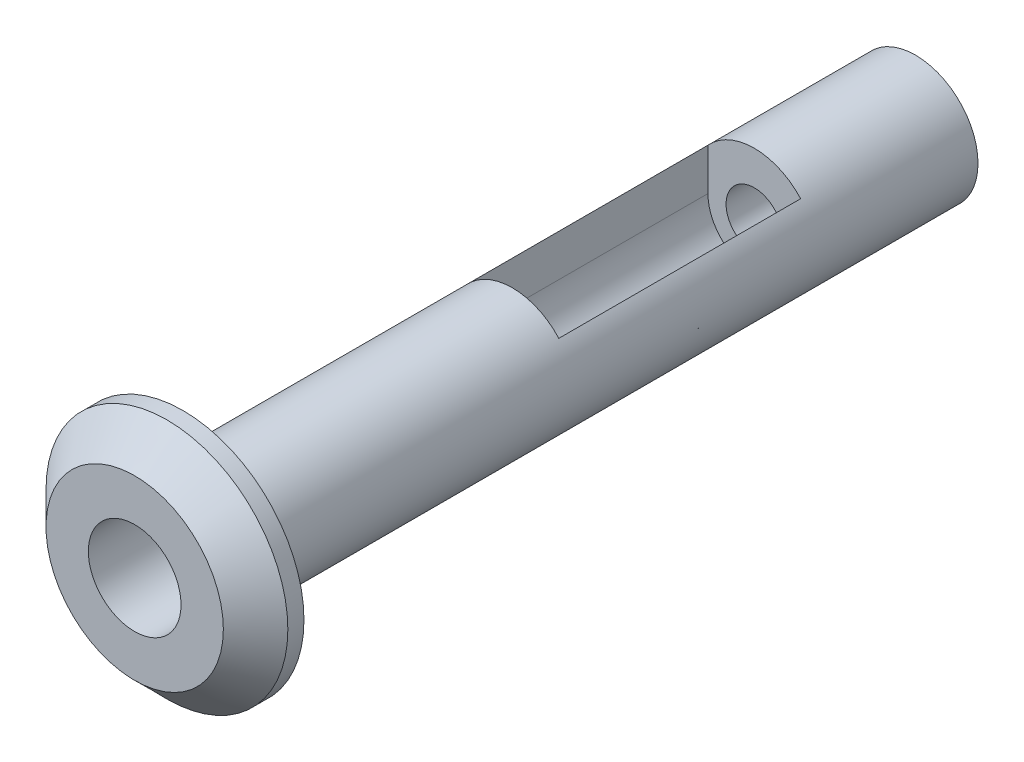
ISO-10303-21;
HEADER;
FILE_DESCRIPTION(('STEP AP214'),'2;1');
FILE_NAME('part.step','',(''),(''),'','','');
FILE_SCHEMA(('AUTOMOTIVE_DESIGN { 1 0 10303 214 1 1 1 1 }'));
ENDSEC;
DATA;
#1=APPLICATION_CONTEXT('core data for automotive mechanical design processes');
#2=APPLICATION_PROTOCOL_DEFINITION('international standard','automotive_design',2000,#1);
#3=PRODUCT_CONTEXT('',#1,'mechanical');
#4=PRODUCT('Part','Part','',(#3));
#5=PRODUCT_RELATED_PRODUCT_CATEGORY('part','',(#4));
#6=PRODUCT_DEFINITION_FORMATION('','',#4);
#7=PRODUCT_DEFINITION_CONTEXT('part definition',#1,'design');
#8=PRODUCT_DEFINITION('design','',#6,#7);
#9=PRODUCT_DEFINITION_SHAPE('','',#8);
#10=(LENGTH_UNIT() NAMED_UNIT(*) SI_UNIT(.MILLI.,.METRE.));
#11=(NAMED_UNIT(*) PLANE_ANGLE_UNIT() SI_UNIT($,.RADIAN.));
#12=(NAMED_UNIT(*) SI_UNIT($,.STERADIAN.) SOLID_ANGLE_UNIT());
#13=UNCERTAINTY_MEASURE_WITH_UNIT(LENGTH_MEASURE(1.E-05),#10,'distance_accuracy_value','');
#14=(GEOMETRIC_REPRESENTATION_CONTEXT(3) GLOBAL_UNCERTAINTY_ASSIGNED_CONTEXT((#13)) GLOBAL_UNIT_ASSIGNED_CONTEXT((#10,
#11,#12)) REPRESENTATION_CONTEXT('',''));
#15=CARTESIAN_POINT('',(0.,0.,0.));
#16=DIRECTION('',(0.,0.,1.));
#17=DIRECTION('',(1.,0.,0.));
#18=AXIS2_PLACEMENT_3D('',#15,#16,#17);
#19=CARTESIAN_POINT('',(0.,0.,-55.0617279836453));
#20=DIRECTION('',(0.,0.,1.));
#21=DIRECTION('',(1.,0.,0.));
#22=AXIS2_PLACEMENT_3D('',#19,#20,#21);
#23=CYLINDRICAL_SURFACE('',#22,2.875);
#24=CARTESIAN_POINT('',(0.,0.,1.5));
#25=DIRECTION('',(0.,0.,1.));
#26=DIRECTION('',(1.,0.,0.));
#27=AXIS2_PLACEMENT_3D('',#24,#25,#26);
#28=CIRCLE('',#27,2.875);
#29=CARTESIAN_POINT('',(2.875,0.,1.5));
#30=VERTEX_POINT('',#29);
#31=EDGE_CURVE('E98',#30,#30,#28,.T.);
#32=ORIENTED_EDGE('',*,*,#31,.T.);
#33=EDGE_LOOP('',(#32));
#34=FACE_BOUND('',#33,.T.);
#35=DIRECTION('',(0.,0.,-1.));
#36=VECTOR('',#35,1.);
#37=CARTESIAN_POINT('',(-2.875,0.,-21.93));
#38=LINE('',#37,#36);
#39=CARTESIAN_POINT('',(-2.875,0.,-21.93));
#40=VERTEX_POINT('',#39);
#41=CARTESIAN_POINT('',(-2.875,0.,-36.93));
#42=VERTEX_POINT('',#41);
#43=EDGE_CURVE('E64',#40,#42,#38,.T.);
#44=ORIENTED_EDGE('',*,*,#43,.F.);
#45=CARTESIAN_POINT('',(0.,0.,-21.93));
#46=DIRECTION('',(0.,0.,1.));
#47=DIRECTION('',(1.,0.,0.));
#48=AXIS2_PLACEMENT_3D('',#45,#46,#47);
#49=CIRCLE('',#48,2.875);
#50=CARTESIAN_POINT('',(2.875,0.,-21.93));
#51=VERTEX_POINT('',#50);
#52=EDGE_CURVE('E12',#40,#51,#49,.F.);
#53=ORIENTED_EDGE('',*,*,#52,.T.);
#54=DIRECTION('',(0.,0.,-1.));
#55=VECTOR('',#54,1.);
#56=CARTESIAN_POINT('',(2.875,0.,-21.93));
#57=LINE('',#56,#55);
#58=CARTESIAN_POINT('',(2.875,0.,-36.93));
#59=VERTEX_POINT('',#58);
#60=EDGE_CURVE('E92',#51,#59,#57,.T.);
#61=ORIENTED_EDGE('',*,*,#60,.T.);
#62=CARTESIAN_POINT('',(0.,0.,-36.93));
#63=DIRECTION('',(0.,0.,-1.));
#64=DIRECTION('',(-1.,0.,0.));
#65=AXIS2_PLACEMENT_3D('',#62,#63,#64);
#66=CIRCLE('',#65,2.875);
#67=EDGE_CURVE('E100',#42,#59,#66,.F.);
#68=ORIENTED_EDGE('',*,*,#67,.F.);
#69=EDGE_LOOP('',(#44,#53,#61,#68));
#70=FACE_BOUND('',#69,.T.);
#71=ADVANCED_FACE('F40',(#34,#70),#23,.F.);
#72=CARTESIAN_POINT('',(0.,0.,-1.5));
#73=DIRECTION('',(0.,0.,1.));
#74=DIRECTION('',(1.,0.,0.));
#75=AXIS2_PLACEMENT_3D('',#72,#73,#74);
#76=PLANE('',#75);
#77=CARTESIAN_POINT('',(0.,0.,-1.5));
#78=DIRECTION('',(0.,0.,1.));
#79=DIRECTION('',(1.,0.,0.));
#80=AXIS2_PLACEMENT_3D('',#77,#78,#79);
#81=CIRCLE('',#80,7.5);
#82=CARTESIAN_POINT('',(7.5,0.,-1.5));
#83=VERTEX_POINT('',#82);
#84=EDGE_CURVE('E121',#83,#83,#81,.T.);
#85=ORIENTED_EDGE('',*,*,#84,.F.);
#86=EDGE_LOOP('',(#85));
#87=FACE_BOUND('',#86,.T.);
#88=CARTESIAN_POINT('',(0.,0.,-1.5));
#89=DIRECTION('',(0.,0.,1.));
#90=DIRECTION('',(1.,0.,0.));
#91=AXIS2_PLACEMENT_3D('',#88,#89,#90);
#92=CIRCLE('',#91,3.875);
#93=CARTESIAN_POINT('',(3.875,0.,-1.5));
#94=VERTEX_POINT('',#93);
#95=EDGE_CURVE('E49',#94,#94,#92,.F.);
#96=ORIENTED_EDGE('',*,*,#95,.F.);
#97=EDGE_LOOP('',(#96));
#98=FACE_BOUND('',#97,.T.);
#99=ADVANCED_FACE('F158',(#87,#98),#76,.F.);
#100=CARTESIAN_POINT('',(0.,0.,1.5));
#101=DIRECTION('',(0.,0.,1.));
#102=DIRECTION('',(1.,0.,0.));
#103=AXIS2_PLACEMENT_3D('',#100,#101,#102);
#104=PLANE('',#103);
#105=ORIENTED_EDGE('',*,*,#31,.F.);
#106=EDGE_LOOP('',(#105));
#107=FACE_BOUND('',#106,.T.);
#108=CARTESIAN_POINT('',(0.,0.,1.5));
#109=DIRECTION('',(0.,0.,1.));
#110=DIRECTION('',(1.,0.,0.));
#111=AXIS2_PLACEMENT_3D('',#108,#109,#110);
#112=CIRCLE('',#111,5.5);
#113=CARTESIAN_POINT('',(5.5,0.,1.5));
#114=VERTEX_POINT('',#113);
#115=EDGE_CURVE('E124',#114,#114,#112,.T.);
#116=ORIENTED_EDGE('',*,*,#115,.T.);
#117=EDGE_LOOP('',(#116));
#118=FACE_BOUND('',#117,.T.);
#119=ADVANCED_FACE('F164',(#107,#118),#104,.T.);
#120=CARTESIAN_POINT('',(0.,0.,1.5));
#121=DIRECTION('',(0.,0.,-1.));
#122=DIRECTION('',(-1.,0.,0.));
#123=AXIS2_PLACEMENT_3D('',#120,#121,#122);
#124=CYLINDRICAL_SURFACE('',#123,7.5);
#125=CARTESIAN_POINT('',(0.,0.,-0.500000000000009));
#126=DIRECTION('',(0.,0.,1.));
#127=DIRECTION('',(1.,0.,0.));
#128=AXIS2_PLACEMENT_3D('',#125,#126,#127);
#129=CIRCLE('',#128,7.5);
#130=CARTESIAN_POINT('',(7.5,0.,-0.500000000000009));
#131=VERTEX_POINT('',#130);
#132=EDGE_CURVE('E127',#131,#131,#129,.F.);
#133=ORIENTED_EDGE('',*,*,#132,.T.);
#134=EDGE_LOOP('',(#133));
#135=FACE_BOUND('',#134,.T.);
#136=ORIENTED_EDGE('',*,*,#84,.T.);
#137=EDGE_LOOP('',(#136));
#138=FACE_BOUND('',#137,.T.);
#139=ADVANCED_FACE('F140',(#135,#138),#124,.T.);
#140=CARTESIAN_POINT('',(0.,0.,1.5));
#141=DIRECTION('',(0.,0.,-1.));
#142=DIRECTION('',(-1.,0.,0.));
#143=AXIS2_PLACEMENT_3D('',#140,#141,#142);
#144=CYLINDRICAL_SURFACE('',#143,1.75);
#145=CARTESIAN_POINT('',(0.,0.,-36.93));
#146=DIRECTION('',(0.,0.,-1.));
#147=DIRECTION('',(-1.,0.,0.));
#148=AXIS2_PLACEMENT_3D('',#145,#146,#147);
#149=CIRCLE('',#148,1.75);
#150=CARTESIAN_POINT('',(-1.75,0.,-36.93));
#151=VERTEX_POINT('',#150);
#152=EDGE_CURVE('E114',#151,#151,#149,.T.);
#153=ORIENTED_EDGE('',*,*,#152,.F.);
#154=EDGE_LOOP('',(#153));
#155=FACE_BOUND('',#154,.T.);
#156=CARTESIAN_POINT('',(0.,0.,-46.93));
#157=DIRECTION('',(0.,0.,-1.));
#158=DIRECTION('',(-1.,0.,0.));
#159=AXIS2_PLACEMENT_3D('',#156,#157,#158);
#160=CIRCLE('',#159,1.75);
#161=CARTESIAN_POINT('',(-1.75,0.,-46.93));
#162=VERTEX_POINT('',#161);
#163=EDGE_CURVE('E115',#162,#162,#160,.T.);
#164=ORIENTED_EDGE('',*,*,#163,.T.);
#165=EDGE_LOOP('',(#164));
#166=FACE_BOUND('',#165,.T.);
#167=ADVANCED_FACE('F137',(#155,#166),#144,.F.);
#168=CARTESIAN_POINT('',(0.,0.,1.5));
#169=DIRECTION('',(0.,0.,-1.));
#170=DIRECTION('',(-1.,0.,0.));
#171=AXIS2_PLACEMENT_3D('',#168,#169,#170);
#172=CONICAL_SURFACE('',#171,5.5,0.785398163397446);
#173=ORIENTED_EDGE('',*,*,#132,.F.);
#174=EDGE_LOOP('',(#173));
#175=FACE_BOUND('',#174,.T.);
#176=ORIENTED_EDGE('',*,*,#115,.F.);
#177=EDGE_LOOP('',(#176));
#178=FACE_BOUND('',#177,.T.);
#179=ADVANCED_FACE('F43',(#175,#178),#172,.T.);
#180=CARTESIAN_POINT('',(0.,0.,-46.93));
#181=DIRECTION('',(0.,0.,-1.));
#182=DIRECTION('',(-1.,0.,0.));
#183=AXIS2_PLACEMENT_3D('',#180,#181,#182);
#184=PLANE('',#183);
#185=CARTESIAN_POINT('',(0.,0.,-46.93));
#186=DIRECTION('',(0.,0.,-1.));
#187=DIRECTION('',(-1.,0.,0.));
#188=AXIS2_PLACEMENT_3D('',#185,#186,#187);
#189=CIRCLE('',#188,3.875);
#190=CARTESIAN_POINT('',(-3.875,0.,-46.93));
#191=VERTEX_POINT('',#190);
#192=EDGE_CURVE('E118',#191,#191,#189,.T.);
#193=ORIENTED_EDGE('',*,*,#192,.T.);
#194=EDGE_LOOP('',(#193));
#195=FACE_BOUND('',#194,.T.);
#196=ORIENTED_EDGE('',*,*,#163,.F.);
#197=EDGE_LOOP('',(#196));
#198=FACE_BOUND('',#197,.T.);
#199=ADVANCED_FACE('F144',(#195,#198),#184,.T.);
#200=CARTESIAN_POINT('',(0.,0.,-46.93));
#201=DIRECTION('',(0.,0.,1.));
#202=DIRECTION('',(1.,0.,0.));
#203=AXIS2_PLACEMENT_3D('',#200,#201,#202);
#204=CYLINDRICAL_SURFACE('',#203,3.875);
#205=DIRECTION('',(0.,0.,-1.));
#206=VECTOR('',#205,1.);
#207=CARTESIAN_POINT('',(2.875,2.59807621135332,-21.93));
#208=LINE('',#207,#206);
#209=CARTESIAN_POINT('',(2.875,2.59807621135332,-21.93));
#210=VERTEX_POINT('',#209);
#211=CARTESIAN_POINT('',(2.875,2.59807621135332,-36.93));
#212=VERTEX_POINT('',#211);
#213=EDGE_CURVE('E56',#210,#212,#208,.T.);
#214=ORIENTED_EDGE('',*,*,#213,.F.);
#215=CARTESIAN_POINT('',(0.,0.,-21.93));
#216=DIRECTION('',(0.,0.,1.));
#217=DIRECTION('',(1.,0.,0.));
#218=AXIS2_PLACEMENT_3D('',#215,#216,#217);
#219=CIRCLE('',#218,3.875);
#220=CARTESIAN_POINT('',(-2.875,2.59807621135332,-21.93));
#221=VERTEX_POINT('',#220);
#222=EDGE_CURVE('E88',#210,#221,#219,.T.);
#223=ORIENTED_EDGE('',*,*,#222,.T.);
#224=DIRECTION('',(0.,0.,-1.));
#225=VECTOR('',#224,1.);
#226=CARTESIAN_POINT('',(-2.875,2.59807621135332,-21.93));
#227=LINE('',#226,#225);
#228=CARTESIAN_POINT('',(-2.875,2.59807621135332,-36.93));
#229=VERTEX_POINT('',#228);
#230=EDGE_CURVE('E101',#221,#229,#227,.T.);
#231=ORIENTED_EDGE('',*,*,#230,.T.);
#232=CARTESIAN_POINT('',(0.,0.,-36.93));
#233=DIRECTION('',(0.,0.,1.));
#234=DIRECTION('',(1.,0.,0.));
#235=AXIS2_PLACEMENT_3D('',#232,#233,#234);
#236=CIRCLE('',#235,3.875);
#237=EDGE_CURVE('E181',#212,#229,#236,.T.);
#238=ORIENTED_EDGE('',*,*,#237,.F.);
#239=EDGE_LOOP('',(#214,#223,#231,#238));
#240=FACE_BOUND('',#239,.T.);
#241=ORIENTED_EDGE('',*,*,#192,.F.);
#242=EDGE_LOOP('',(#241));
#243=FACE_BOUND('',#242,.T.);
#244=ORIENTED_EDGE('',*,*,#95,.T.);
#245=EDGE_LOOP('',(#244));
#246=FACE_BOUND('',#245,.T.);
#247=ADVANCED_FACE('F146',(#240,#243,#246),#204,.T.);
#248=CARTESIAN_POINT('',(0.,0.,-36.93));
#249=DIRECTION('',(0.,0.,-1.));
#250=DIRECTION('',(-1.,0.,0.));
#251=AXIS2_PLACEMENT_3D('',#248,#249,#250);
#252=PLANE('',#251);
#253=ORIENTED_EDGE('',*,*,#152,.T.);
#254=EDGE_LOOP('',(#253));
#255=FACE_BOUND('',#254,.T.);
#256=DIRECTION('',(0.,-1.,0.));
#257=VECTOR('',#256,1.);
#258=CARTESIAN_POINT('',(-2.875,0.,-36.93));
#259=LINE('',#258,#257);
#260=EDGE_CURVE('E89',#229,#42,#259,.T.);
#261=ORIENTED_EDGE('',*,*,#260,.T.);
#262=ORIENTED_EDGE('',*,*,#67,.T.);
#263=DIRECTION('',(0.,1.,0.));
#264=VECTOR('',#263,1.);
#265=CARTESIAN_POINT('',(2.875,0.,-36.93));
#266=LINE('',#265,#264);
#267=EDGE_CURVE('E94',#59,#212,#266,.T.);
#268=ORIENTED_EDGE('',*,*,#267,.T.);
#269=ORIENTED_EDGE('',*,*,#237,.T.);
#270=EDGE_LOOP('',(#261,#262,#268,#269));
#271=FACE_BOUND('',#270,.T.);
#272=ADVANCED_FACE('F134',(#255,#271),#252,.F.);
#273=CARTESIAN_POINT('',(0.,0.,-21.93));
#274=DIRECTION('',(0.,0.,1.));
#275=DIRECTION('',(1.,0.,0.));
#276=AXIS2_PLACEMENT_3D('',#273,#274,#275);
#277=PLANE('',#276);
#278=DIRECTION('',(0.,-1.,0.));
#279=VECTOR('',#278,1.);
#280=CARTESIAN_POINT('',(-2.875,0.,-21.93));
#281=LINE('',#280,#279);
#282=EDGE_CURVE('E102',#221,#40,#281,.T.);
#283=ORIENTED_EDGE('',*,*,#282,.F.);
#284=ORIENTED_EDGE('',*,*,#222,.F.);
#285=DIRECTION('',(0.,1.,0.));
#286=VECTOR('',#285,1.);
#287=CARTESIAN_POINT('',(2.875,0.,-21.93));
#288=LINE('',#287,#286);
#289=EDGE_CURVE('E83',#51,#210,#288,.T.);
#290=ORIENTED_EDGE('',*,*,#289,.F.);
#291=ORIENTED_EDGE('',*,*,#52,.F.);
#292=EDGE_LOOP('',(#283,#284,#290,#291));
#293=FACE_BOUND('',#292,.T.);
#294=ADVANCED_FACE('F86',(#293),#277,.F.);
#295=CARTESIAN_POINT('',(2.875,0.,-21.93));
#296=DIRECTION('',(-1.,0.,0.));
#297=DIRECTION('',(0.,0.,1.));
#298=AXIS2_PLACEMENT_3D('',#295,#296,#297);
#299=PLANE('',#298);
#300=ORIENTED_EDGE('',*,*,#267,.F.);
#301=ORIENTED_EDGE('',*,*,#60,.F.);
#302=ORIENTED_EDGE('',*,*,#289,.T.);
#303=ORIENTED_EDGE('',*,*,#213,.T.);
#304=EDGE_LOOP('',(#300,#301,#302,#303));
#305=FACE_BOUND('',#304,.T.);
#306=ADVANCED_FACE('F93',(#305),#299,.T.);
#307=CARTESIAN_POINT('',(-2.875,0.,-21.93));
#308=DIRECTION('',(1.,0.,0.));
#309=DIRECTION('',(0.,0.,-1.));
#310=AXIS2_PLACEMENT_3D('',#307,#308,#309);
#311=PLANE('',#310);
#312=ORIENTED_EDGE('',*,*,#260,.F.);
#313=ORIENTED_EDGE('',*,*,#230,.F.);
#314=ORIENTED_EDGE('',*,*,#282,.T.);
#315=ORIENTED_EDGE('',*,*,#43,.T.);
#316=EDGE_LOOP('',(#312,#313,#314,#315));
#317=FACE_BOUND('',#316,.T.);
#318=ADVANCED_FACE('F177',(#317),#311,.T.);
#319=CLOSED_SHELL('',(#71,#99,#119,#139,#167,#179,#199,#247,#272,#294,#306,#318));
#320=MANIFOLD_SOLID_BREP('B2',#319);
#321=ADVANCED_BREP_SHAPE_REPRESENTATION('',(#18,#320),#14);
#322=SHAPE_DEFINITION_REPRESENTATION(#9,#321);
ENDSEC;
END-ISO-10303-21;
